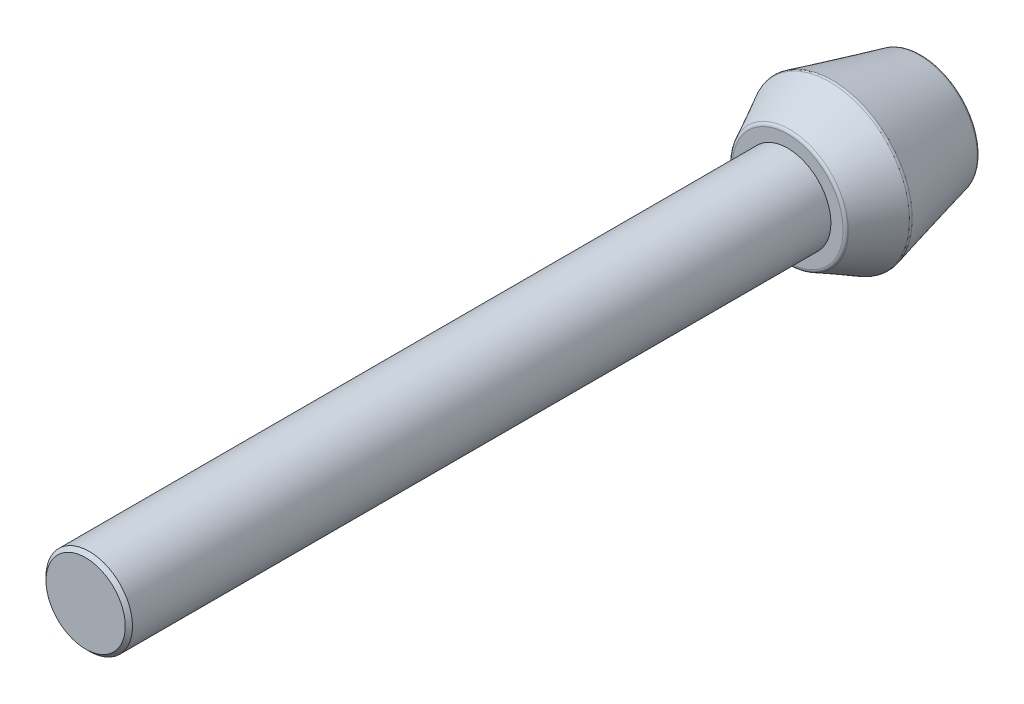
ISO-10303-21;
HEADER;
FILE_DESCRIPTION(('STEP AP214'),'2;1');
FILE_NAME('part.step','',(''),(''),'','','');
FILE_SCHEMA(('AUTOMOTIVE_DESIGN { 1 0 10303 214 1 1 1 1 }'));
ENDSEC;
DATA;
#1=APPLICATION_CONTEXT('core data for automotive mechanical design processes');
#2=APPLICATION_PROTOCOL_DEFINITION('international standard','automotive_design',2000,#1);
#3=PRODUCT_CONTEXT('',#1,'mechanical');
#4=PRODUCT('Part','Part','',(#3));
#5=PRODUCT_RELATED_PRODUCT_CATEGORY('part','',(#4));
#6=PRODUCT_DEFINITION_FORMATION('','',#4);
#7=PRODUCT_DEFINITION_CONTEXT('part definition',#1,'design');
#8=PRODUCT_DEFINITION('design','',#6,#7);
#9=PRODUCT_DEFINITION_SHAPE('','',#8);
#10=(LENGTH_UNIT() NAMED_UNIT(*) SI_UNIT(.MILLI.,.METRE.));
#11=(NAMED_UNIT(*) PLANE_ANGLE_UNIT() SI_UNIT($,.RADIAN.));
#12=(NAMED_UNIT(*) SI_UNIT($,.STERADIAN.) SOLID_ANGLE_UNIT());
#13=UNCERTAINTY_MEASURE_WITH_UNIT(LENGTH_MEASURE(1.E-05),#10,'distance_accuracy_value','');
#14=(GEOMETRIC_REPRESENTATION_CONTEXT(3) GLOBAL_UNCERTAINTY_ASSIGNED_CONTEXT((#13)) GLOBAL_UNIT_ASSIGNED_CONTEXT((#10,
#11,#12)) REPRESENTATION_CONTEXT('',''));
#15=CARTESIAN_POINT('',(0.,0.,0.));
#16=DIRECTION('',(0.,0.,1.));
#17=DIRECTION('',(1.,0.,0.));
#18=AXIS2_PLACEMENT_3D('',#15,#16,#17);
#19=CARTESIAN_POINT('',(0.,0.,18.599999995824));
#20=DIRECTION('',(0.,0.,-1.));
#21=DIRECTION('',(0.769107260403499,-0.639119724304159,0.));
#22=AXIS2_PLACEMENT_3D('',#19,#20,#21);
#23=PLANE('',#22);
#24=CARTESIAN_POINT('',(1.94289029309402E-13,0.,18.599999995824));
#25=DIRECTION('',(0.,0.,-1.));
#26=DIRECTION('',(0.,1.,0.));
#27=AXIS2_PLACEMENT_3D('',#24,#25,#26);
#28=CIRCLE('',#27,6.);
#29=CARTESIAN_POINT('',(1.94289029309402E-13,6.,18.599999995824));
#30=VERTEX_POINT('',#29);
#31=EDGE_CURVE('E25',#30,#30,#28,.F.);
#32=ORIENTED_EDGE('',*,*,#31,.F.);
#33=EDGE_LOOP('',(#32));
#34=FACE_BOUND('',#33,.T.);
#35=CARTESIAN_POINT('',(0.,0.,18.599999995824));
#36=DIRECTION('',(0.,0.,1.));
#37=DIRECTION('',(0.769107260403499,-0.639119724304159,0.));
#38=AXIS2_PLACEMENT_3D('',#35,#36,#37);
#39=CIRCLE('',#38,7.69778215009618);
#40=CARTESIAN_POINT('',(5.92042014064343,-4.91980440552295,18.599999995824));
#41=VERTEX_POINT('',#40);
#42=EDGE_CURVE('E19',#41,#41,#39,.T.);
#43=ORIENTED_EDGE('',*,*,#42,.T.);
#44=EDGE_LOOP('',(#43));
#45=FACE_BOUND('',#44,.T.);
#46=ADVANCED_FACE('F15',(#34,#45),#23,.F.);
#47=CARTESIAN_POINT('',(0.,0.,18.099999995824));
#48=DIRECTION('',(0.,0.,-1.));
#49=DIRECTION('',(0.769107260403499,-0.639119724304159,0.));
#50=AXIS2_PLACEMENT_3D('',#47,#48,#49);
#51=TOROIDAL_SURFACE('',#50,7.69778215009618,0.5);
#52=CARTESIAN_POINT('',(0.,0.,18.332416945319));
#53=DIRECTION('',(0.,0.,-1.));
#54=DIRECTION('',(0.769107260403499,-0.639119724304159,0.));
#55=AXIS2_PLACEMENT_3D('',#52,#53,#54);
#56=CIRCLE('',#55,8.14048110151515);
#57=CARTESIAN_POINT('',(6.26090311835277,-5.20274203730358,18.332416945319));
#58=VERTEX_POINT('',#57);
#59=EDGE_CURVE('E120',#58,#58,#56,.T.);
#60=ORIENTED_EDGE('',*,*,#59,.F.);
#61=EDGE_LOOP('',(#60));
#62=FACE_BOUND('',#61,.T.);
#63=ORIENTED_EDGE('',*,*,#42,.F.);
#64=EDGE_LOOP('',(#63));
#65=FACE_BOUND('',#64,.T.);
#66=ADVANCED_FACE('F55',(#62,#65),#51,.T.);
#67=CARTESIAN_POINT('',(0.,0.,18.599999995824));
#68=DIRECTION('',(0.,0.,-1.));
#69=DIRECTION('',(0.769107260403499,-0.639119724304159,0.));
#70=AXIS2_PLACEMENT_3D('',#67,#68,#69);
#71=CONICAL_SURFACE('',#70,8.,0.483447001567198);
#72=CARTESIAN_POINT('',(0.,0.,12.7687657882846));
#73=DIRECTION('',(0.,0.,1.));
#74=DIRECTION('',(-0.769107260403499,0.639119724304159,0.));
#75=AXIS2_PLACEMENT_3D('',#72,#73,#74);
#76=CIRCLE('',#75,11.0613979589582);
#77=CARTESIAN_POINT('',(-8.50740148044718,7.06955761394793,12.7687657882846));
#78=VERTEX_POINT('',#77);
#79=EDGE_CURVE('E114',#78,#78,#76,.T.);
#80=ORIENTED_EDGE('',*,*,#79,.T.);
#81=EDGE_LOOP('',(#80));
#82=FACE_BOUND('',#81,.T.);
#83=ORIENTED_EDGE('',*,*,#59,.T.);
#84=EDGE_LOOP('',(#83));
#85=FACE_BOUND('',#84,.T.);
#86=ADVANCED_FACE('F67',(#82,#85),#71,.T.);
#87=CARTESIAN_POINT('',(0.,0.,12.5363488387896));
#88=DIRECTION('',(0.,0.,-1.));
#89=DIRECTION('',(0.769107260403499,-0.639119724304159,0.));
#90=AXIS2_PLACEMENT_3D('',#87,#88,#89);
#91=TOROIDAL_SURFACE('',#90,10.6186990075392,0.5);
#92=CARTESIAN_POINT('',(0.,0.,12.4150810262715));
#93=DIRECTION('',(0.,0.,-1.));
#94=DIRECTION('',(0.769107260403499,-0.639119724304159,0.));
#95=AXIS2_PLACEMENT_3D('',#92,#93,#94);
#96=CIRCLE('',#95,11.1037702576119);
#97=CARTESIAN_POINT('',(8.53999032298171,-7.09663858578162,12.4150810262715));
#98=VERTEX_POINT('',#97);
#99=EDGE_CURVE('E127',#98,#98,#96,.T.);
#100=ORIENTED_EDGE('',*,*,#99,.F.);
#101=EDGE_LOOP('',(#100));
#102=FACE_BOUND('',#101,.T.);
#103=ORIENTED_EDGE('',*,*,#79,.F.);
#104=EDGE_LOOP('',(#103));
#105=FACE_BOUND('',#104,.T.);
#106=ADVANCED_FACE('F64',(#102,#105),#91,.T.);
#107=CARTESIAN_POINT('',(0.,0.,-4.17600781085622E-09));
#108=DIRECTION('',(0.,0.,1.));
#109=DIRECTION('',(-0.769107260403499,0.639119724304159,0.));
#110=AXIS2_PLACEMENT_3D('',#107,#108,#109);
#111=CONICAL_SURFACE('',#110,8.,0.244978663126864);
#112=ORIENTED_EDGE('',*,*,#99,.T.);
#113=EDGE_LOOP('',(#112));
#114=FACE_BOUND('',#113,.T.);
#115=CARTESIAN_POINT('',(0.,0.,0.378732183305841));
#116=DIRECTION('',(0.,0.,1.));
#117=DIRECTION('',(0.769107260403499,-0.639119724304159,0.));
#118=AXIS2_PLACEMENT_3D('',#115,#116,#117);
#119=CIRCLE('',#118,8.09468304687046);
#120=CARTESIAN_POINT('',(6.22567950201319,-5.1734715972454,0.378732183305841));
#121=VERTEX_POINT('',#120);
#122=EDGE_CURVE('E119',#121,#121,#119,.T.);
#123=ORIENTED_EDGE('',*,*,#122,.T.);
#124=EDGE_LOOP('',(#123));
#125=FACE_BOUND('',#124,.T.);
#126=ADVANCED_FACE('F66',(#114,#125),#111,.T.);
#127=CARTESIAN_POINT('',(0.,0.,0.49999999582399));
#128=DIRECTION('',(0.,0.,-1.));
#129=DIRECTION('',(0.769107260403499,-0.639119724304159,0.));
#130=AXIS2_PLACEMENT_3D('',#127,#128,#129);
#131=TOROIDAL_SURFACE('',#130,7.60961179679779,0.5);
#132=CARTESIAN_POINT('',(0.,0.,-4.17600781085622E-09));
#133=DIRECTION('',(0.,0.,-1.));
#134=DIRECTION('',(0.769107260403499,-0.639119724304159,0.));
#135=AXIS2_PLACEMENT_3D('',#132,#133,#134);
#136=CIRCLE('',#135,7.60961179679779);
#137=CARTESIAN_POINT('',(5.8526076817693,-4.86345299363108,-4.17600870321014E-09));
#138=VERTEX_POINT('',#137);
#139=EDGE_CURVE('E115',#138,#138,#136,.T.);
#140=ORIENTED_EDGE('',*,*,#139,.F.);
#141=EDGE_LOOP('',(#140));
#142=FACE_BOUND('',#141,.T.);
#143=ORIENTED_EDGE('',*,*,#122,.F.);
#144=EDGE_LOOP('',(#143));
#145=FACE_BOUND('',#144,.T.);
#146=ADVANCED_FACE('F17',(#142,#145),#131,.T.);
#147=CARTESIAN_POINT('',(0.,0.,-4.17600781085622E-09));
#148=DIRECTION('',(0.,0.,-1.));
#149=DIRECTION('',(0.769107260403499,-0.639119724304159,0.));
#150=AXIS2_PLACEMENT_3D('',#147,#148,#149);
#151=PLANE('',#150);
#152=ORIENTED_EDGE('',*,*,#139,.T.);
#153=EDGE_LOOP('',(#152));
#154=FACE_BOUND('',#153,.T.);
#155=ADVANCED_FACE('F60',(#154),#151,.T.);
#156=CARTESIAN_POINT('',(1.94289029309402E-13,0.,3.59999999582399));
#157=DIRECTION('',(0.,0.,1.));
#158=DIRECTION('',(-0.692363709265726,0.721548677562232,0.));
#159=AXIS2_PLACEMENT_3D('',#156,#157,#158);
#160=CYLINDRICAL_SURFACE('',#159,6.);
#161=CARTESIAN_POINT('',(1.94289029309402E-13,0.,115.499999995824));
#162=DIRECTION('',(0.,0.,-1.));
#163=DIRECTION('',(0.692363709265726,-0.721548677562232,0.));
#164=AXIS2_PLACEMENT_3D('',#161,#162,#163);
#165=CIRCLE('',#164,6.);
#166=CARTESIAN_POINT('',(4.15418225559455,-4.3292920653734,115.499999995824));
#167=VERTEX_POINT('',#166);
#168=EDGE_CURVE('E100',#167,#167,#165,.T.);
#169=ORIENTED_EDGE('',*,*,#168,.T.);
#170=EDGE_LOOP('',(#169));
#171=FACE_BOUND('',#170,.T.);
#172=ORIENTED_EDGE('',*,*,#31,.T.);
#173=EDGE_LOOP('',(#172));
#174=FACE_BOUND('',#173,.T.);
#175=ADVANCED_FACE('F62',(#171,#174),#160,.T.);
#176=CARTESIAN_POINT('',(1.94289029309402E-13,0.,115.499999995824));
#177=DIRECTION('',(0.,0.,-1.));
#178=DIRECTION('',(0.692363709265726,-0.721548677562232,0.));
#179=AXIS2_PLACEMENT_3D('',#176,#177,#178);
#180=CONICAL_SURFACE('',#179,6.,0.785398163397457);
#181=ORIENTED_EDGE('',*,*,#168,.F.);
#182=EDGE_LOOP('',(#181));
#183=FACE_BOUND('',#182,.T.);
#184=CARTESIAN_POINT('',(1.94289029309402E-13,0.,115.999999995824));
#185=DIRECTION('',(0.,0.,1.));
#186=DIRECTION('',(0.692363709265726,-0.721548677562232,0.));
#187=AXIS2_PLACEMENT_3D('',#184,#185,#186);
#188=CIRCLE('',#187,5.5);
#189=CARTESIAN_POINT('',(3.80800040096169,-3.96851772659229,115.999999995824));
#190=VERTEX_POINT('',#189);
#191=EDGE_CURVE('E107',#190,#190,#188,.T.);
#192=ORIENTED_EDGE('',*,*,#191,.F.);
#193=EDGE_LOOP('',(#192));
#194=FACE_BOUND('',#193,.T.);
#195=ADVANCED_FACE('F81',(#183,#194),#180,.T.);
#196=CARTESIAN_POINT('',(1.94289029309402E-13,0.,115.999999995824));
#197=DIRECTION('',(0.,0.,-1.));
#198=DIRECTION('',(0.692363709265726,-0.721548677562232,0.));
#199=AXIS2_PLACEMENT_3D('',#196,#197,#198);
#200=PLANE('',#199);
#201=ORIENTED_EDGE('',*,*,#191,.T.);
#202=EDGE_LOOP('',(#201));
#203=FACE_BOUND('',#202,.T.);
#204=ADVANCED_FACE('F79',(#203),#200,.F.);
#205=CLOSED_SHELL('',(#46,#66,#86,#106,#126,#146,#155,#175,#195,#204));
#206=CARTESIAN_POINT('',(1.94289029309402E-13,0.,3.59999999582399));
#207=DIRECTION('',(0.,0.,-1.));
#208=DIRECTION('',(0.692363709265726,-0.721548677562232,0.));
#209=AXIS2_PLACEMENT_3D('',#206,#207,#208);
#210=PLANE('',#209);
#211=CARTESIAN_POINT('',(0.,0.,3.59999999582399));
#212=DIRECTION('',(0.,0.,-1.));
#213=DIRECTION('',(0.,1.,0.));
#214=AXIS2_PLACEMENT_3D('',#211,#212,#213);
#215=CIRCLE('',#214,5.);
#216=CARTESIAN_POINT('',(0.,4.99999999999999,3.59999999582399));
#217=VERTEX_POINT('',#216);
#218=EDGE_CURVE('E9',#217,#217,#215,.T.);
#219=ORIENTED_EDGE('',*,*,#218,.T.);
#220=EDGE_LOOP('',(#219));
#221=FACE_BOUND('',#220,.T.);
#222=ADVANCED_FACE('F38',(#221),#210,.T.);
#223=CARTESIAN_POINT('',(0.,0.,2.79999999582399));
#224=DIRECTION('',(0.,0.,1.));
#225=DIRECTION('',(-0.769107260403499,0.639119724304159,0.));
#226=AXIS2_PLACEMENT_3D('',#223,#224,#225);
#227=CONICAL_SURFACE('',#226,5.,1.30899693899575);
#228=CARTESIAN_POINT('',(0.,0.,2.79999999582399));
#229=DIRECTION('',(0.,0.,1.));
#230=DIRECTION('',(-0.769107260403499,0.639119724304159,0.));
#231=AXIS2_PLACEMENT_3D('',#228,#229,#230);
#232=CIRCLE('',#231,5.);
#233=CARTESIAN_POINT('',(-3.8455363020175,3.19559862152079,2.79999999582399));
#234=VERTEX_POINT('',#233);
#235=EDGE_CURVE('E111',#234,#234,#232,.T.);
#236=ORIENTED_EDGE('',*,*,#235,.T.);
#237=EDGE_LOOP('',(#236));
#238=FACE_BOUND('',#237,.T.);
#239=CARTESIAN_POINT('',(0.,0.,1.46025403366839));
#240=VERTEX_POINT('',#239);
#241=VERTEX_LOOP('',#240);
#242=FACE_BOUND('',#241,.T.);
#243=ADVANCED_FACE('F35',(#238,#242),#227,.F.);
#244=CARTESIAN_POINT('',(0.,0.,2.79999999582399));
#245=DIRECTION('',(0.,0.,1.));
#246=DIRECTION('',(-0.769107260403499,0.639119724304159,0.));
#247=AXIS2_PLACEMENT_3D('',#244,#245,#246);
#248=CYLINDRICAL_SURFACE('',#247,5.);
#249=ORIENTED_EDGE('',*,*,#218,.F.);
#250=EDGE_LOOP('',(#249));
#251=FACE_BOUND('',#250,.T.);
#252=ORIENTED_EDGE('',*,*,#235,.F.);
#253=EDGE_LOOP('',(#252));
#254=FACE_BOUND('',#253,.T.);
#255=ADVANCED_FACE('F37',(#251,#254),#248,.F.);
#256=CLOSED_SHELL('',(#222,#243,#255));
#257=ORIENTED_CLOSED_SHELL('',*,#256,.T.);
#258=BREP_WITH_VOIDS('B1',#205,(#257));
#259=ADVANCED_BREP_SHAPE_REPRESENTATION('',(#18,#258),#14);
#260=SHAPE_DEFINITION_REPRESENTATION(#9,#259);
ENDSEC;
END-ISO-10303-21;
